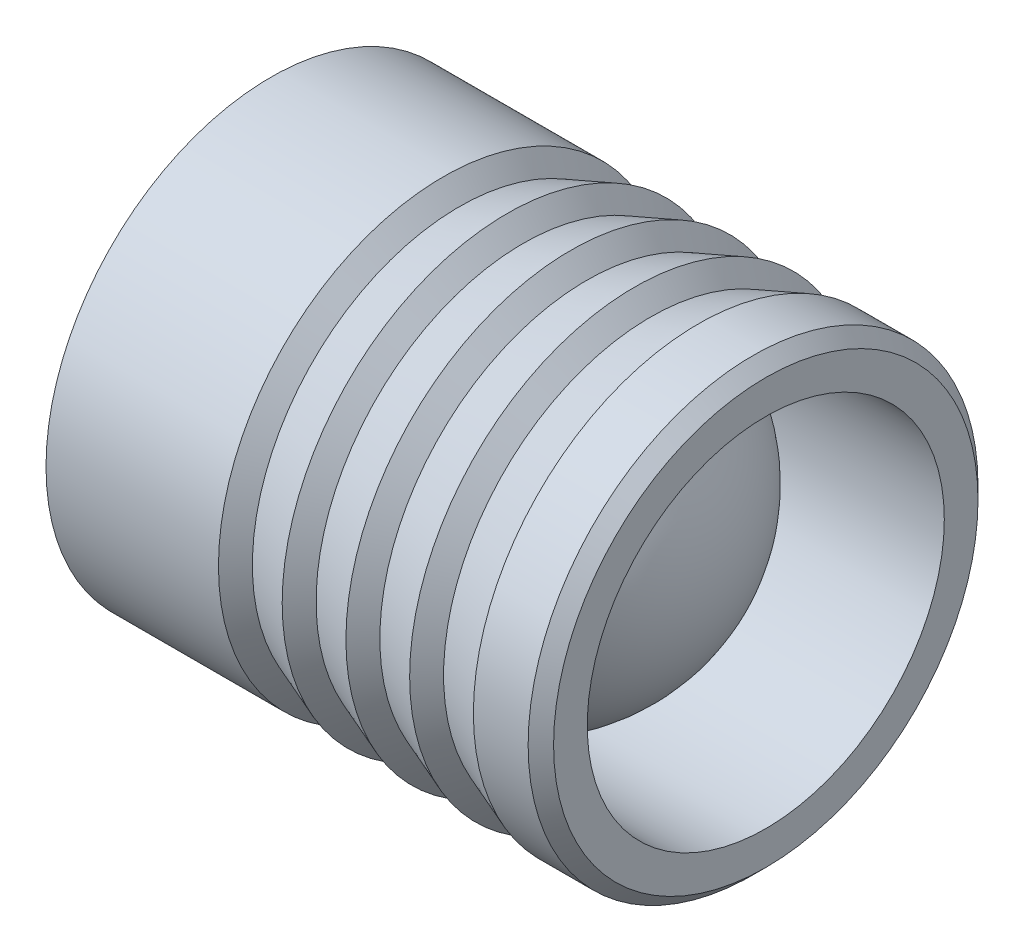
ISO-10303-21;
HEADER;
FILE_DESCRIPTION(('STEP AP214'),'2;1');
FILE_NAME('part.step','',(''),(''),'','','');
FILE_SCHEMA(('AUTOMOTIVE_DESIGN { 1 0 10303 214 1 1 1 1 }'));
ENDSEC;
DATA;
#1=APPLICATION_CONTEXT('core data for automotive mechanical design processes');
#2=APPLICATION_PROTOCOL_DEFINITION('international standard','automotive_design',2000,#1);
#3=PRODUCT_CONTEXT('',#1,'mechanical');
#4=PRODUCT('Part','Part','',(#3));
#5=PRODUCT_RELATED_PRODUCT_CATEGORY('part','',(#4));
#6=PRODUCT_DEFINITION_FORMATION('','',#4);
#7=PRODUCT_DEFINITION_CONTEXT('part definition',#1,'design');
#8=PRODUCT_DEFINITION('design','',#6,#7);
#9=PRODUCT_DEFINITION_SHAPE('','',#8);
#10=(LENGTH_UNIT() NAMED_UNIT(*) SI_UNIT(.MILLI.,.METRE.));
#11=(NAMED_UNIT(*) PLANE_ANGLE_UNIT() SI_UNIT($,.RADIAN.));
#12=(NAMED_UNIT(*) SI_UNIT($,.STERADIAN.) SOLID_ANGLE_UNIT());
#13=UNCERTAINTY_MEASURE_WITH_UNIT(LENGTH_MEASURE(1.E-05),#10,'distance_accuracy_value','');
#14=(GEOMETRIC_REPRESENTATION_CONTEXT(3) GLOBAL_UNCERTAINTY_ASSIGNED_CONTEXT((#13)) GLOBAL_UNIT_ASSIGNED_CONTEXT((#10,
#11,#12)) REPRESENTATION_CONTEXT('',''));
#15=CARTESIAN_POINT('',(0.,0.,0.));
#16=DIRECTION('',(0.,0.,1.));
#17=DIRECTION('',(1.,0.,0.));
#18=AXIS2_PLACEMENT_3D('',#15,#16,#17);
#19=CARTESIAN_POINT('',(1.9995,0.,0.));
#20=DIRECTION('',(1.,0.,0.));
#21=DIRECTION('',(0.,-1.,0.));
#22=AXIS2_PLACEMENT_3D('',#19,#20,#21);
#23=SPHERICAL_SURFACE('',#22,1.2005);
#24=CARTESIAN_POINT('',(2.15412935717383,0.,0.));
#25=DIRECTION('',(-1.,0.,0.));
#26=DIRECTION('',(0.,0.,1.));
#27=AXIS2_PLACEMENT_3D('',#24,#25,#26);
#28=CIRCLE('',#27,1.1904999);
#29=CARTESIAN_POINT('',(2.15412935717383,0.,1.1904999));
#30=VERTEX_POINT('',#29);
#31=EDGE_CURVE('E39',#30,#30,#28,.T.);
#32=ORIENTED_EDGE('',*,*,#31,.F.);
#33=EDGE_LOOP('',(#32));
#34=FACE_BOUND('',#33,.T.);
#35=CARTESIAN_POINT('',(3.2,0.,0.));
#36=VERTEX_POINT('',#35);
#37=VERTEX_LOOP('',#36);
#38=FACE_BOUND('',#37,.T.);
#39=ADVANCED_FACE('F18',(#34,#38),#23,.T.);
#40=CARTESIAN_POINT('',(3.6,1.41514718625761,0.));
#41=DIRECTION('',(-1.,0.,0.));
#42=DIRECTION('',(0.,0.,1.));
#43=AXIS2_PLACEMENT_3D('',#40,#41,#42);
#44=PLANE('',#43);
#45=CARTESIAN_POINT('',(3.6,0.,0.));
#46=DIRECTION('',(1.,0.,0.));
#47=DIRECTION('',(0.,0.,-1.));
#48=AXIS2_PLACEMENT_3D('',#45,#46,#47);
#49=CIRCLE('',#48,1.4151471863);
#50=CARTESIAN_POINT('',(3.6,0.,-1.41514718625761));
#51=VERTEX_POINT('',#50);
#52=EDGE_CURVE('E11',#51,#51,#49,.T.);
#53=ORIENTED_EDGE('',*,*,#52,.T.);
#54=EDGE_LOOP('',(#53));
#55=FACE_BOUND('',#54,.T.);
#56=CARTESIAN_POINT('',(3.6,0.,0.));
#57=DIRECTION('',(1.,0.,0.));
#58=DIRECTION('',(0.,0.,-1.));
#59=AXIS2_PLACEMENT_3D('',#56,#57,#58);
#60=CIRCLE('',#59,1.1904999);
#61=CARTESIAN_POINT('',(3.6,0.,-1.1904999));
#62=VERTEX_POINT('',#61);
#63=EDGE_CURVE('E28',#62,#62,#60,.T.);
#64=ORIENTED_EDGE('',*,*,#63,.F.);
#65=EDGE_LOOP('',(#64));
#66=FACE_BOUND('',#65,.T.);
#67=ADVANCED_FACE('F177',(#55,#66),#44,.F.);
#68=CARTESIAN_POINT('',(3.6,0.,0.));
#69=DIRECTION('',(-1.,0.,0.));
#70=DIRECTION('',(0.,0.,-1.));
#71=AXIS2_PLACEMENT_3D('',#68,#69,#70);
#72=CYLINDRICAL_SURFACE('',#71,1.1904999);
#73=ORIENTED_EDGE('',*,*,#63,.T.);
#74=EDGE_LOOP('',(#73));
#75=FACE_BOUND('',#74,.T.);
#76=ORIENTED_EDGE('',*,*,#31,.T.);
#77=EDGE_LOOP('',(#76));
#78=FACE_BOUND('',#77,.T.);
#79=ADVANCED_FACE('F174',(#75,#78),#72,.F.);
#80=CARTESIAN_POINT('',(0.,0.,0.));
#81=DIRECTION('',(1.,0.,0.));
#82=DIRECTION('',(0.,1.,0.));
#83=AXIS2_PLACEMENT_3D('',#80,#81,#82);
#84=PLANE('',#83);
#85=CARTESIAN_POINT('',(0.,0.,0.));
#86=DIRECTION('',(1.,0.,0.));
#87=DIRECTION('',(0.,0.,-1.));
#88=AXIS2_PLACEMENT_3D('',#85,#86,#87);
#89=CIRCLE('',#88,0.9803847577);
#90=CARTESIAN_POINT('',(0.,0.,-0.980384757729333));
#91=VERTEX_POINT('',#90);
#92=EDGE_CURVE('E126',#91,#91,#89,.T.);
#93=ORIENTED_EDGE('',*,*,#92,.F.);
#94=EDGE_LOOP('',(#93));
#95=FACE_BOUND('',#94,.T.);
#96=ADVANCED_FACE('F176',(#95),#84,.F.);
#97=CARTESIAN_POINT('',(3.51514718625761,0.,0.));
#98=DIRECTION('',(-1.,0.,0.));
#99=DIRECTION('',(0.,0.,1.));
#100=AXIS2_PLACEMENT_3D('',#97,#98,#99);
#101=CONICAL_SURFACE('',#100,1.5,0.7853981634);
#102=CARTESIAN_POINT('',(3.51514718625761,0.,0.));
#103=DIRECTION('',(1.,0.,0.));
#104=DIRECTION('',(0.,0.,-1.));
#105=AXIS2_PLACEMENT_3D('',#102,#103,#104);
#106=CIRCLE('',#105,1.5);
#107=CARTESIAN_POINT('',(3.51514718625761,0.,-1.5));
#108=VERTEX_POINT('',#107);
#109=EDGE_CURVE('E108',#108,#108,#106,.T.);
#110=ORIENTED_EDGE('',*,*,#109,.T.);
#111=EDGE_LOOP('',(#110));
#112=FACE_BOUND('',#111,.T.);
#113=ORIENTED_EDGE('',*,*,#52,.F.);
#114=EDGE_LOOP('',(#113));
#115=FACE_BOUND('',#114,.T.);
#116=ADVANCED_FACE('F185',(#112,#115),#101,.T.);
#117=CARTESIAN_POINT('',(3.6,0.,0.));
#118=DIRECTION('',(-1.,0.,0.));
#119=DIRECTION('',(0.,0.,-1.));
#120=AXIS2_PLACEMENT_3D('',#117,#118,#119);
#121=CYLINDRICAL_SURFACE('',#120,1.5);
#122=CARTESIAN_POINT('',(3.15,0.,0.));
#123=DIRECTION('',(1.,0.,0.));
#124=DIRECTION('',(0.,0.,-1.));
#125=AXIS2_PLACEMENT_3D('',#122,#123,#124);
#126=CIRCLE('',#125,1.5);
#127=CARTESIAN_POINT('',(3.15,0.,-1.5));
#128=VERTEX_POINT('',#127);
#129=EDGE_CURVE('E103',#128,#128,#126,.T.);
#130=ORIENTED_EDGE('',*,*,#129,.T.);
#131=EDGE_LOOP('',(#130));
#132=FACE_BOUND('',#131,.T.);
#133=ORIENTED_EDGE('',*,*,#109,.F.);
#134=EDGE_LOOP('',(#133));
#135=FACE_BOUND('',#134,.T.);
#136=ADVANCED_FACE('F210',(#132,#135),#121,.T.);
#137=CARTESIAN_POINT('',(2.83125,0.,0.));
#138=DIRECTION('',(1.,0.,0.));
#139=DIRECTION('',(0.,0.,-1.));
#140=AXIS2_PLACEMENT_3D('',#137,#138,#139);
#141=CONICAL_SURFACE('',#140,1.38,0.3600593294);
#142=ORIENTED_EDGE('',*,*,#129,.F.);
#143=EDGE_LOOP('',(#142));
#144=FACE_BOUND('',#143,.T.);
#145=CARTESIAN_POINT('',(2.83125,0.,0.));
#146=DIRECTION('',(1.,0.,0.));
#147=DIRECTION('',(0.,0.,-1.));
#148=AXIS2_PLACEMENT_3D('',#145,#146,#147);
#149=CIRCLE('',#148,1.38);
#150=CARTESIAN_POINT('',(2.83125,0.,-1.38));
#151=VERTEX_POINT('',#150);
#152=EDGE_CURVE('E109',#151,#151,#149,.T.);
#153=ORIENTED_EDGE('',*,*,#152,.T.);
#154=EDGE_LOOP('',(#153));
#155=FACE_BOUND('',#154,.T.);
#156=ADVANCED_FACE('F104',(#144,#155),#141,.T.);
#157=CARTESIAN_POINT('',(2.725,0.,0.));
#158=DIRECTION('',(-1.,0.,0.));
#159=DIRECTION('',(0.,0.,1.));
#160=AXIS2_PLACEMENT_3D('',#157,#158,#159);
#161=CONICAL_SURFACE('',#160,1.5,0.8460969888);
#162=CARTESIAN_POINT('',(2.725,0.,0.));
#163=DIRECTION('',(1.,0.,0.));
#164=DIRECTION('',(0.,0.,-1.));
#165=AXIS2_PLACEMENT_3D('',#162,#163,#164);
#166=CIRCLE('',#165,1.5);
#167=CARTESIAN_POINT('',(2.725,0.,-1.5));
#168=VERTEX_POINT('',#167);
#169=EDGE_CURVE('E119',#168,#168,#166,.T.);
#170=ORIENTED_EDGE('',*,*,#169,.T.);
#171=EDGE_LOOP('',(#170));
#172=FACE_BOUND('',#171,.T.);
#173=ORIENTED_EDGE('',*,*,#152,.F.);
#174=EDGE_LOOP('',(#173));
#175=FACE_BOUND('',#174,.T.);
#176=ADVANCED_FACE('F200',(#172,#175),#161,.T.);
#177=CARTESIAN_POINT('',(2.40625,0.,0.));
#178=DIRECTION('',(1.,0.,0.));
#179=DIRECTION('',(0.,0.,-1.));
#180=AXIS2_PLACEMENT_3D('',#177,#178,#179);
#181=CONICAL_SURFACE('',#180,1.38,0.3600593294);
#182=ORIENTED_EDGE('',*,*,#169,.F.);
#183=EDGE_LOOP('',(#182));
#184=FACE_BOUND('',#183,.T.);
#185=CARTESIAN_POINT('',(2.40625,0.,0.));
#186=DIRECTION('',(1.,0.,0.));
#187=DIRECTION('',(0.,0.,-1.));
#188=AXIS2_PLACEMENT_3D('',#185,#186,#187);
#189=CIRCLE('',#188,1.38);
#190=CARTESIAN_POINT('',(2.40625,0.,-1.38));
#191=VERTEX_POINT('',#190);
#192=EDGE_CURVE('E164',#191,#191,#189,.T.);
#193=ORIENTED_EDGE('',*,*,#192,.T.);
#194=EDGE_LOOP('',(#193));
#195=FACE_BOUND('',#194,.T.);
#196=ADVANCED_FACE('F196',(#184,#195),#181,.T.);
#197=CARTESIAN_POINT('',(2.3,0.,0.));
#198=DIRECTION('',(-1.,0.,0.));
#199=DIRECTION('',(0.,0.,1.));
#200=AXIS2_PLACEMENT_3D('',#197,#198,#199);
#201=CONICAL_SURFACE('',#200,1.5,0.8460969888);
#202=CARTESIAN_POINT('',(2.3,0.,0.));
#203=DIRECTION('',(1.,0.,0.));
#204=DIRECTION('',(0.,0.,-1.));
#205=AXIS2_PLACEMENT_3D('',#202,#203,#204);
#206=CIRCLE('',#205,1.5);
#207=CARTESIAN_POINT('',(2.3,0.,-1.5));
#208=VERTEX_POINT('',#207);
#209=EDGE_CURVE('E136',#208,#208,#206,.T.);
#210=ORIENTED_EDGE('',*,*,#209,.T.);
#211=EDGE_LOOP('',(#210));
#212=FACE_BOUND('',#211,.T.);
#213=ORIENTED_EDGE('',*,*,#192,.F.);
#214=EDGE_LOOP('',(#213));
#215=FACE_BOUND('',#214,.T.);
#216=ADVANCED_FACE('F199',(#212,#215),#201,.T.);
#217=CARTESIAN_POINT('',(1.98125,0.,0.));
#218=DIRECTION('',(1.,0.,0.));
#219=DIRECTION('',(0.,0.,-1.));
#220=AXIS2_PLACEMENT_3D('',#217,#218,#219);
#221=CONICAL_SURFACE('',#220,1.38,0.3600593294);
#222=ORIENTED_EDGE('',*,*,#209,.F.);
#223=EDGE_LOOP('',(#222));
#224=FACE_BOUND('',#223,.T.);
#225=CARTESIAN_POINT('',(1.98125,0.,0.));
#226=DIRECTION('',(1.,0.,0.));
#227=DIRECTION('',(0.,0.,-1.));
#228=AXIS2_PLACEMENT_3D('',#225,#226,#227);
#229=CIRCLE('',#228,1.38);
#230=CARTESIAN_POINT('',(1.98125,0.,-1.38));
#231=VERTEX_POINT('',#230);
#232=EDGE_CURVE('E132',#231,#231,#229,.T.);
#233=ORIENTED_EDGE('',*,*,#232,.T.);
#234=EDGE_LOOP('',(#233));
#235=FACE_BOUND('',#234,.T.);
#236=ADVANCED_FACE('F211',(#224,#235),#221,.T.);
#237=CARTESIAN_POINT('',(1.875,0.,0.));
#238=DIRECTION('',(-1.,0.,0.));
#239=DIRECTION('',(0.,0.,1.));
#240=AXIS2_PLACEMENT_3D('',#237,#238,#239);
#241=CONICAL_SURFACE('',#240,1.5,0.8460969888);
#242=CARTESIAN_POINT('',(1.875,0.,0.));
#243=DIRECTION('',(1.,0.,0.));
#244=DIRECTION('',(0.,0.,-1.));
#245=AXIS2_PLACEMENT_3D('',#242,#243,#244);
#246=CIRCLE('',#245,1.5);
#247=CARTESIAN_POINT('',(1.875,0.,-1.5));
#248=VERTEX_POINT('',#247);
#249=EDGE_CURVE('E137',#248,#248,#246,.T.);
#250=ORIENTED_EDGE('',*,*,#249,.T.);
#251=EDGE_LOOP('',(#250));
#252=FACE_BOUND('',#251,.T.);
#253=ORIENTED_EDGE('',*,*,#232,.F.);
#254=EDGE_LOOP('',(#253));
#255=FACE_BOUND('',#254,.T.);
#256=ADVANCED_FACE('F214',(#252,#255),#241,.T.);
#257=CARTESIAN_POINT('',(1.55625,0.,0.));
#258=DIRECTION('',(1.,0.,0.));
#259=DIRECTION('',(0.,0.,-1.));
#260=AXIS2_PLACEMENT_3D('',#257,#258,#259);
#261=CONICAL_SURFACE('',#260,1.38,0.3600593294);
#262=ORIENTED_EDGE('',*,*,#249,.F.);
#263=EDGE_LOOP('',(#262));
#264=FACE_BOUND('',#263,.T.);
#265=CARTESIAN_POINT('',(1.55625,0.,0.));
#266=DIRECTION('',(1.,0.,0.));
#267=DIRECTION('',(0.,0.,-1.));
#268=AXIS2_PLACEMENT_3D('',#265,#266,#267);
#269=CIRCLE('',#268,1.38);
#270=CARTESIAN_POINT('',(1.55625,0.,-1.38));
#271=VERTEX_POINT('',#270);
#272=EDGE_CURVE('E145',#271,#271,#269,.T.);
#273=ORIENTED_EDGE('',*,*,#272,.T.);
#274=EDGE_LOOP('',(#273));
#275=FACE_BOUND('',#274,.T.);
#276=ADVANCED_FACE('F228',(#264,#275),#261,.T.);
#277=CARTESIAN_POINT('',(1.45,0.,0.));
#278=DIRECTION('',(-1.,0.,0.));
#279=DIRECTION('',(0.,0.,1.));
#280=AXIS2_PLACEMENT_3D('',#277,#278,#279);
#281=CONICAL_SURFACE('',#280,1.5,0.8460969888);
#282=CARTESIAN_POINT('',(1.45,0.,0.));
#283=DIRECTION('',(1.,0.,0.));
#284=DIRECTION('',(0.,0.,-1.));
#285=AXIS2_PLACEMENT_3D('',#282,#283,#284);
#286=CIRCLE('',#285,1.5);
#287=CARTESIAN_POINT('',(1.45,0.,-1.5));
#288=VERTEX_POINT('',#287);
#289=EDGE_CURVE('E148',#288,#288,#286,.T.);
#290=ORIENTED_EDGE('',*,*,#289,.T.);
#291=EDGE_LOOP('',(#290));
#292=FACE_BOUND('',#291,.T.);
#293=ORIENTED_EDGE('',*,*,#272,.F.);
#294=EDGE_LOOP('',(#293));
#295=FACE_BOUND('',#294,.T.);
#296=ADVANCED_FACE('F230',(#292,#295),#281,.T.);
#297=CARTESIAN_POINT('',(3.6,0.,0.));
#298=DIRECTION('',(-1.,0.,0.));
#299=DIRECTION('',(0.,0.,-1.));
#300=AXIS2_PLACEMENT_3D('',#297,#298,#299);
#301=CYLINDRICAL_SURFACE('',#300,1.5);
#302=CARTESIAN_POINT('',(0.3,0.,0.));
#303=DIRECTION('',(1.,0.,0.));
#304=DIRECTION('',(0.,0.,-1.));
#305=AXIS2_PLACEMENT_3D('',#302,#303,#304);
#306=CIRCLE('',#305,1.5);
#307=CARTESIAN_POINT('',(0.3,0.,-1.5));
#308=VERTEX_POINT('',#307);
#309=EDGE_CURVE('E140',#308,#308,#306,.T.);
#310=ORIENTED_EDGE('',*,*,#309,.T.);
#311=EDGE_LOOP('',(#310));
#312=FACE_BOUND('',#311,.T.);
#313=ORIENTED_EDGE('',*,*,#289,.F.);
#314=EDGE_LOOP('',(#313));
#315=FACE_BOUND('',#314,.T.);
#316=ADVANCED_FACE('F219',(#312,#315),#301,.T.);
#317=CARTESIAN_POINT('',(0.,0.,0.));
#318=DIRECTION('',(1.,0.,0.));
#319=DIRECTION('',(0.,0.,-1.));
#320=AXIS2_PLACEMENT_3D('',#317,#318,#319);
#321=CONICAL_SURFACE('',#320,0.9803847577,1.0471975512);
#322=ORIENTED_EDGE('',*,*,#309,.F.);
#323=EDGE_LOOP('',(#322));
#324=FACE_BOUND('',#323,.T.);
#325=ORIENTED_EDGE('',*,*,#92,.T.);
#326=EDGE_LOOP('',(#325));
#327=FACE_BOUND('',#326,.T.);
#328=ADVANCED_FACE('F216',(#324,#327),#321,.T.);
#329=CLOSED_SHELL('',(#39,#67,#79,#96,#116,#136,#156,#176,#196,#216,#236,#256,#276,#296,#316,#328));
#330=CARTESIAN_POINT('',(0.867335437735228,0.,0.));
#331=DIRECTION('',(1.,0.,0.));
#332=DIRECTION('',(0.,0.,-1.));
#333=AXIS2_PLACEMENT_3D('',#330,#331,#332);
#334=CONICAL_SURFACE('',#333,1.1904999,1.0471975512);
#335=CARTESIAN_POINT('',(0.867335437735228,0.,0.));
#336=DIRECTION('',(1.,0.,0.));
#337=DIRECTION('',(0.,0.,-1.));
#338=AXIS2_PLACEMENT_3D('',#335,#336,#337);
#339=CIRCLE('',#338,1.1904999);
#340=CARTESIAN_POINT('',(0.867335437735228,0.,-1.1904999));
#341=VERTEX_POINT('',#340);
#342=EDGE_CURVE('E124',#341,#341,#339,.T.);
#343=ORIENTED_EDGE('',*,*,#342,.T.);
#344=EDGE_LOOP('',(#343));
#345=FACE_BOUND('',#344,.T.);
#346=CARTESIAN_POINT('',(0.18,0.,0.));
#347=VERTEX_POINT('',#346);
#348=VERTEX_LOOP('',#347);
#349=FACE_BOUND('',#348,.T.);
#350=ADVANCED_FACE('F20',(#345,#349),#334,.F.);
#351=CARTESIAN_POINT('',(1.9995,0.,0.));
#352=DIRECTION('',(1.,0.,0.));
#353=DIRECTION('',(0.,-1.,0.));
#354=AXIS2_PLACEMENT_3D('',#351,#352,#353);
#355=SPHERICAL_SURFACE('',#354,1.2005);
#356=CARTESIAN_POINT('',(1.84487064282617,0.,0.));
#357=DIRECTION('',(1.,0.,0.));
#358=DIRECTION('',(0.,0.,-1.));
#359=AXIS2_PLACEMENT_3D('',#356,#357,#358);
#360=CIRCLE('',#359,1.1904999);
#361=CARTESIAN_POINT('',(1.84487064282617,0.,-1.1904999));
#362=VERTEX_POINT('',#361);
#363=EDGE_CURVE('E127',#362,#362,#360,.T.);
#364=ORIENTED_EDGE('',*,*,#363,.F.);
#365=EDGE_LOOP('',(#364));
#366=FACE_BOUND('',#365,.T.);
#367=CARTESIAN_POINT('',(0.799,0.,0.));
#368=VERTEX_POINT('',#367);
#369=VERTEX_LOOP('',#368);
#370=FACE_BOUND('',#369,.T.);
#371=ADVANCED_FACE('F202',(#366,#370),#355,.T.);
#372=CARTESIAN_POINT('',(3.6,0.,0.));
#373=DIRECTION('',(-1.,0.,0.));
#374=DIRECTION('',(0.,0.,-1.));
#375=AXIS2_PLACEMENT_3D('',#372,#373,#374);
#376=CYLINDRICAL_SURFACE('',#375,1.1904999);
#377=ORIENTED_EDGE('',*,*,#363,.T.);
#378=EDGE_LOOP('',(#377));
#379=FACE_BOUND('',#378,.T.);
#380=ORIENTED_EDGE('',*,*,#342,.F.);
#381=EDGE_LOOP('',(#380));
#382=FACE_BOUND('',#381,.T.);
#383=ADVANCED_FACE('F205',(#379,#382),#376,.F.);
#384=CLOSED_SHELL('',(#350,#371,#383));
#385=ORIENTED_CLOSED_SHELL('',*,#384,.T.);
#386=BREP_WITH_VOIDS('B1',#329,(#385));
#387=ADVANCED_BREP_SHAPE_REPRESENTATION('',(#18,#386),#14);
#388=SHAPE_DEFINITION_REPRESENTATION(#9,#387);
ENDSEC;
END-ISO-10303-21;
